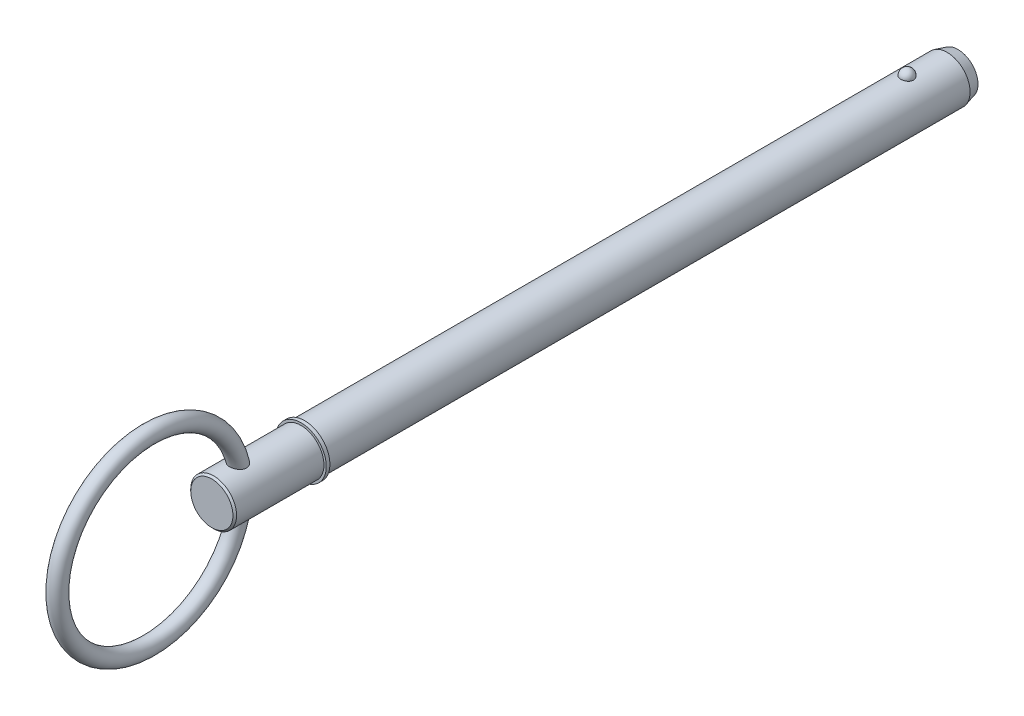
from build123d import *

# Parameters (mm, degrees)
SKETCH2_R           = 6.35
BOSS_EXTRUDE1_DEPTH = 165.1
BOSS_EXTRUDE2_START = 15.88
SKETCH3_R           = 6.35
BOSS_EXTRUDE2_DEPTH = 15.88
CHAMFER1_SIZE       = 3
CHAMFER1_SIZE2      = 0.803847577
SKETCH20_W          = 1
SKETCH20_H          = 7
SKETCH21_R          = 6.35
BOSS_EXTRUDE3_DEPTH = 25.7
CHAMFER2_SIZE       = 0.5
SKETCH24_R          = 2.25


with BuildPart() as part:
    # Sketch2 → Boss-Extrude1 (new body)
    with BuildSketch(Plane.XY):
        Circle(SKETCH2_R)
    extrude(amount=BOSS_EXTRUDE1_DEPTH)

    # Sketch3 → Boss-Extrude2 (add)
    with BuildSketch(Plane(origin=(0, 0, 0), x_dir=(-1, 0, 0), z_dir=(0, 0, -1)).offset(BOSS_EXTRUDE2_START)):
        Circle(SKETCH3_R)
    extrude(amount=-BOSS_EXTRUDE2_DEPTH)

    # Chamfer1
    chamfer1_edges = [part.edges().sort_by_distance(p)[0] for p in [
        (6.35, 0, -15.88),
    ]]
    chamfer1_side = [part.faces().sort_by_distance(p)[0] for p in [
        (6.35, 0, -7.94),
    ]]
    chamfer(chamfer1_edges, length=CHAMFER1_SIZE, length2=CHAMFER1_SIZE2, reference=chamfer1_side[0])

    # Sketch18 → Revolve1 (revolve)
    with BuildSketch(Plane(origin=(0, 0, 0), x_dir=(0, 0, -1), z_dir=(1, 0, 0))):
        with BuildLine():
            Line((1.78, 8.13), (1.78, 4.57))
            ThreePointArc((1.78, 4.57), (0, 6.35), (1.78, 8.13))
        make_face()
    revolve(axis=Axis((0, 8.13, -1.78), (0, -1, 0)))

    # Sketch20 → Revolve2 (revolve)
    with BuildSketch(Plane(origin=(0, 0, 0), x_dir=(0, 0, -1), z_dir=(1, 0, 0)), mode=Mode.PRIVATE) as revolve2_sk:
        with Locations((-165.6, 3.5)):
            Rectangle(SKETCH20_W, SKETCH20_H)
    revolve(revolve2_sk.sketch.rotate(Axis((0, 0, 33.728787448), (0, 0, 1)), 270), axis=Axis((0, 0, 33.728787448), (0, 0, 1)))

    # Sketch21 → Boss-Extrude3 (add)
    with BuildSketch(Plane(origin=(0, 0, 165.1), x_dir=(-1, 0, 0), z_dir=(0, 0, -1))):
        with Locations(Location((0, 0, 0), (0, 0, 180))):
            Circle(SKETCH21_R)
    extrude(amount=-BOSS_EXTRUDE3_DEPTH)

    # Chamfer2
    chamfer2_edges = [part.edges().sort_by_distance(p)[0] for p in [
        (-6.35, 0, 190.8),
    ]]
    chamfer(chamfer2_edges, length=CHAMFER2_SIZE)

    # Sweep1: sweep along a path in Sketch23
    with BuildLine(Plane(origin=(0, 0, 0), x_dir=(0, 0, -1), z_dir=(1, 0, 0))) as sweep1_path:
        CenterArc((-208.2, 0), 25.4, 0, 360)
    # Sketch24 → Sweep1 (sweep)
    with BuildSketch(Plane(origin=(0, 0, 0), x_dir=(1, 0, 0), z_dir=(0, 1, 0))):
        with Locations((0, -182.8)):
            Circle(SKETCH24_R)
    sweep(path=sweep1_path.line)


solid = part.part
